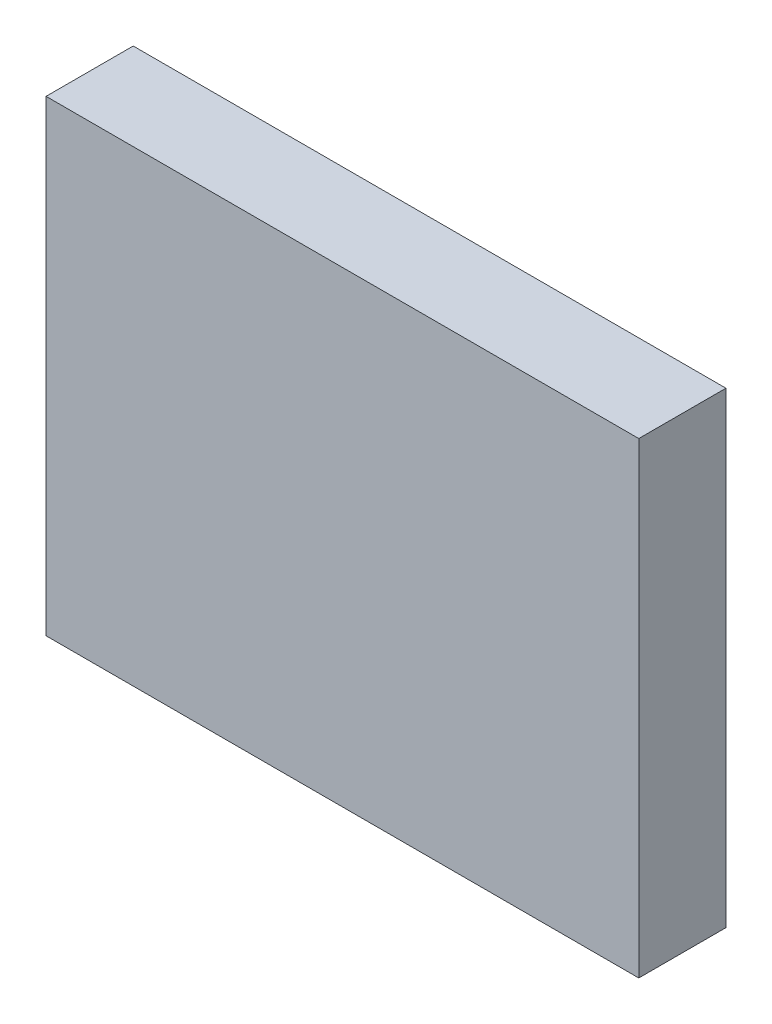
ISO-10303-21;
HEADER;
FILE_DESCRIPTION(('STEP AP214'),'2;1');
FILE_NAME('part.step','',(''),(''),'','','');
FILE_SCHEMA(('AUTOMOTIVE_DESIGN { 1 0 10303 214 1 1 1 1 }'));
ENDSEC;
DATA;
#1=APPLICATION_CONTEXT('core data for automotive mechanical design processes');
#2=APPLICATION_PROTOCOL_DEFINITION('international standard','automotive_design',2000,#1);
#3=PRODUCT_CONTEXT('',#1,'mechanical');
#4=PRODUCT('Part','Part','',(#3));
#5=PRODUCT_RELATED_PRODUCT_CATEGORY('part','',(#4));
#6=PRODUCT_DEFINITION_FORMATION('','',#4);
#7=PRODUCT_DEFINITION_CONTEXT('part definition',#1,'design');
#8=PRODUCT_DEFINITION('design','',#6,#7);
#9=PRODUCT_DEFINITION_SHAPE('','',#8);
#10=(LENGTH_UNIT() NAMED_UNIT(*) SI_UNIT(.MILLI.,.METRE.));
#11=(NAMED_UNIT(*) PLANE_ANGLE_UNIT() SI_UNIT($,.RADIAN.));
#12=(NAMED_UNIT(*) SI_UNIT($,.STERADIAN.) SOLID_ANGLE_UNIT());
#13=UNCERTAINTY_MEASURE_WITH_UNIT(LENGTH_MEASURE(1.E-05),#10,'distance_accuracy_value','');
#14=(GEOMETRIC_REPRESENTATION_CONTEXT(3) GLOBAL_UNCERTAINTY_ASSIGNED_CONTEXT((#13)) GLOBAL_UNIT_ASSIGNED_CONTEXT((#10,
#11,#12)) REPRESENTATION_CONTEXT('',''));
#15=CARTESIAN_POINT('',(0.,0.,0.));
#16=DIRECTION('',(0.,0.,1.));
#17=DIRECTION('',(1.,0.,0.));
#18=AXIS2_PLACEMENT_3D('',#15,#16,#17);
#19=CARTESIAN_POINT('',(-42500.,33500.,-12500.));
#20=DIRECTION('',(0.,1.,0.));
#21=DIRECTION('',(-1.,0.,0.));
#22=AXIS2_PLACEMENT_3D('',#19,#20,#21);
#23=PLANE('',#22);
#24=DIRECTION('',(-1.,0.,0.));
#25=VECTOR('',#24,1.);
#26=CARTESIAN_POINT('',(-42500.,33500.,0.));
#27=LINE('',#26,#25);
#28=CARTESIAN_POINT('',(42500.,33500.,0.));
#29=VERTEX_POINT('',#28);
#30=CARTESIAN_POINT('',(-42500.,33500.,0.));
#31=VERTEX_POINT('',#30);
#32=EDGE_CURVE('E114',#29,#31,#27,.T.);
#33=ORIENTED_EDGE('',*,*,#32,.F.);
#34=DIRECTION('',(0.,0.,1.));
#35=VECTOR('',#34,1.);
#36=CARTESIAN_POINT('',(42500.,33500.,-12500.));
#37=LINE('',#36,#35);
#38=CARTESIAN_POINT('',(42500.,33500.,-12500.));
#39=VERTEX_POINT('',#38);
#40=EDGE_CURVE('E11',#39,#29,#37,.T.);
#41=ORIENTED_EDGE('',*,*,#40,.F.);
#42=DIRECTION('',(-1.,0.,0.));
#43=VECTOR('',#42,1.);
#44=CARTESIAN_POINT('',(-42500.,33500.,-12500.));
#45=LINE('',#44,#43);
#46=CARTESIAN_POINT('',(-42500.,33500.,-12500.));
#47=VERTEX_POINT('',#46);
#48=EDGE_CURVE('E107',#39,#47,#45,.T.);
#49=ORIENTED_EDGE('',*,*,#48,.T.);
#50=DIRECTION('',(0.,0.,1.));
#51=VECTOR('',#50,1.);
#52=CARTESIAN_POINT('',(-42500.,33500.,-12500.));
#53=LINE('',#52,#51);
#54=EDGE_CURVE('E50',#47,#31,#53,.T.);
#55=ORIENTED_EDGE('',*,*,#54,.T.);
#56=EDGE_LOOP('',(#33,#41,#49,#55));
#57=FACE_BOUND('',#56,.T.);
#58=ADVANCED_FACE('F42',(#57),#23,.T.);
#59=CARTESIAN_POINT('',(42500.,-33500.,-12500.));
#60=DIRECTION('',(1.,0.,0.));
#61=DIRECTION('',(0.,0.,-1.));
#62=AXIS2_PLACEMENT_3D('',#59,#60,#61);
#63=PLANE('',#62);
#64=DIRECTION('',(0.,1.,0.));
#65=VECTOR('',#64,1.);
#66=CARTESIAN_POINT('',(42500.,-33500.,0.));
#67=LINE('',#66,#65);
#68=CARTESIAN_POINT('',(42500.,-33500.,0.));
#69=VERTEX_POINT('',#68);
#70=EDGE_CURVE('E106',#69,#29,#67,.T.);
#71=ORIENTED_EDGE('',*,*,#70,.F.);
#72=DIRECTION('',(0.,0.,1.));
#73=VECTOR('',#72,1.);
#74=CARTESIAN_POINT('',(42500.,-33500.,-12500.));
#75=LINE('',#74,#73);
#76=CARTESIAN_POINT('',(42500.,-33500.,-12500.));
#77=VERTEX_POINT('',#76);
#78=EDGE_CURVE('E53',#77,#69,#75,.T.);
#79=ORIENTED_EDGE('',*,*,#78,.F.);
#80=DIRECTION('',(0.,1.,0.));
#81=VECTOR('',#80,1.);
#82=CARTESIAN_POINT('',(42500.,-33500.,-12500.));
#83=LINE('',#82,#81);
#84=EDGE_CURVE('E102',#77,#39,#83,.T.);
#85=ORIENTED_EDGE('',*,*,#84,.T.);
#86=ORIENTED_EDGE('',*,*,#40,.T.);
#87=EDGE_LOOP('',(#71,#79,#85,#86));
#88=FACE_BOUND('',#87,.T.);
#89=ADVANCED_FACE('F127',(#88),#63,.T.);
#90=CARTESIAN_POINT('',(-42500.,-33500.,-12500.));
#91=DIRECTION('',(0.,-1.,0.));
#92=DIRECTION('',(1.,0.,0.));
#93=AXIS2_PLACEMENT_3D('',#90,#91,#92);
#94=PLANE('',#93);
#95=DIRECTION('',(1.,0.,0.));
#96=VECTOR('',#95,1.);
#97=CARTESIAN_POINT('',(-42500.,-33500.,0.));
#98=LINE('',#97,#96);
#99=CARTESIAN_POINT('',(-42500.,-33500.,0.));
#100=VERTEX_POINT('',#99);
#101=EDGE_CURVE('E94',#100,#69,#98,.T.);
#102=ORIENTED_EDGE('',*,*,#101,.F.);
#103=DIRECTION('',(0.,0.,1.));
#104=VECTOR('',#103,1.);
#105=CARTESIAN_POINT('',(-42500.,-33500.,-12500.));
#106=LINE('',#105,#104);
#107=CARTESIAN_POINT('',(-42500.,-33500.,-12500.));
#108=VERTEX_POINT('',#107);
#109=EDGE_CURVE('E89',#108,#100,#106,.T.);
#110=ORIENTED_EDGE('',*,*,#109,.F.);
#111=DIRECTION('',(1.,0.,0.));
#112=VECTOR('',#111,1.);
#113=CARTESIAN_POINT('',(-42500.,-33500.,-12500.));
#114=LINE('',#113,#112);
#115=EDGE_CURVE('E93',#108,#77,#114,.T.);
#116=ORIENTED_EDGE('',*,*,#115,.T.);
#117=ORIENTED_EDGE('',*,*,#78,.T.);
#118=EDGE_LOOP('',(#102,#110,#116,#117));
#119=FACE_BOUND('',#118,.T.);
#120=ADVANCED_FACE('F95',(#119),#94,.T.);
#121=CARTESIAN_POINT('',(-42500.,-33500.,-12500.));
#122=DIRECTION('',(-1.,0.,0.));
#123=DIRECTION('',(0.,0.,1.));
#124=AXIS2_PLACEMENT_3D('',#121,#122,#123);
#125=PLANE('',#124);
#126=DIRECTION('',(0.,-1.,0.));
#127=VECTOR('',#126,1.);
#128=CARTESIAN_POINT('',(-42500.,-33500.,0.));
#129=LINE('',#128,#127);
#130=EDGE_CURVE('E119',#31,#100,#129,.T.);
#131=ORIENTED_EDGE('',*,*,#130,.F.);
#132=ORIENTED_EDGE('',*,*,#54,.F.);
#133=DIRECTION('',(0.,-1.,0.));
#134=VECTOR('',#133,1.);
#135=CARTESIAN_POINT('',(-42500.,-33500.,-12500.));
#136=LINE('',#135,#134);
#137=EDGE_CURVE('E99',#47,#108,#136,.T.);
#138=ORIENTED_EDGE('',*,*,#137,.T.);
#139=ORIENTED_EDGE('',*,*,#109,.T.);
#140=EDGE_LOOP('',(#131,#132,#138,#139));
#141=FACE_BOUND('',#140,.T.);
#142=ADVANCED_FACE('F101',(#141),#125,.T.);
#143=CARTESIAN_POINT('',(0.,0.,-12500.));
#144=DIRECTION('',(0.,0.,1.));
#145=DIRECTION('',(1.,0.,0.));
#146=AXIS2_PLACEMENT_3D('',#143,#144,#145);
#147=PLANE('',#146);
#148=ORIENTED_EDGE('',*,*,#48,.F.);
#149=ORIENTED_EDGE('',*,*,#84,.F.);
#150=ORIENTED_EDGE('',*,*,#115,.F.);
#151=ORIENTED_EDGE('',*,*,#137,.F.);
#152=EDGE_LOOP('',(#148,#149,#150,#151));
#153=FACE_BOUND('',#152,.T.);
#154=ADVANCED_FACE('F98',(#153),#147,.F.);
#155=CARTESIAN_POINT('',(0.,0.,0.));
#156=DIRECTION('',(0.,0.,1.));
#157=DIRECTION('',(1.,0.,0.));
#158=AXIS2_PLACEMENT_3D('',#155,#156,#157);
#159=PLANE('',#158);
#160=ORIENTED_EDGE('',*,*,#32,.T.);
#161=ORIENTED_EDGE('',*,*,#130,.T.);
#162=ORIENTED_EDGE('',*,*,#101,.T.);
#163=ORIENTED_EDGE('',*,*,#70,.T.);
#164=EDGE_LOOP('',(#160,#161,#162,#163));
#165=FACE_BOUND('',#164,.T.);
#166=ADVANCED_FACE('F129',(#165),#159,.T.);
#167=CLOSED_SHELL('',(#58,#89,#120,#142,#154,#166));
#168=MANIFOLD_SOLID_BREP('B2',#167);
#169=ADVANCED_BREP_SHAPE_REPRESENTATION('',(#18,#168),#14);
#170=SHAPE_DEFINITION_REPRESENTATION(#9,#169);
ENDSEC;
END-ISO-10303-21;
